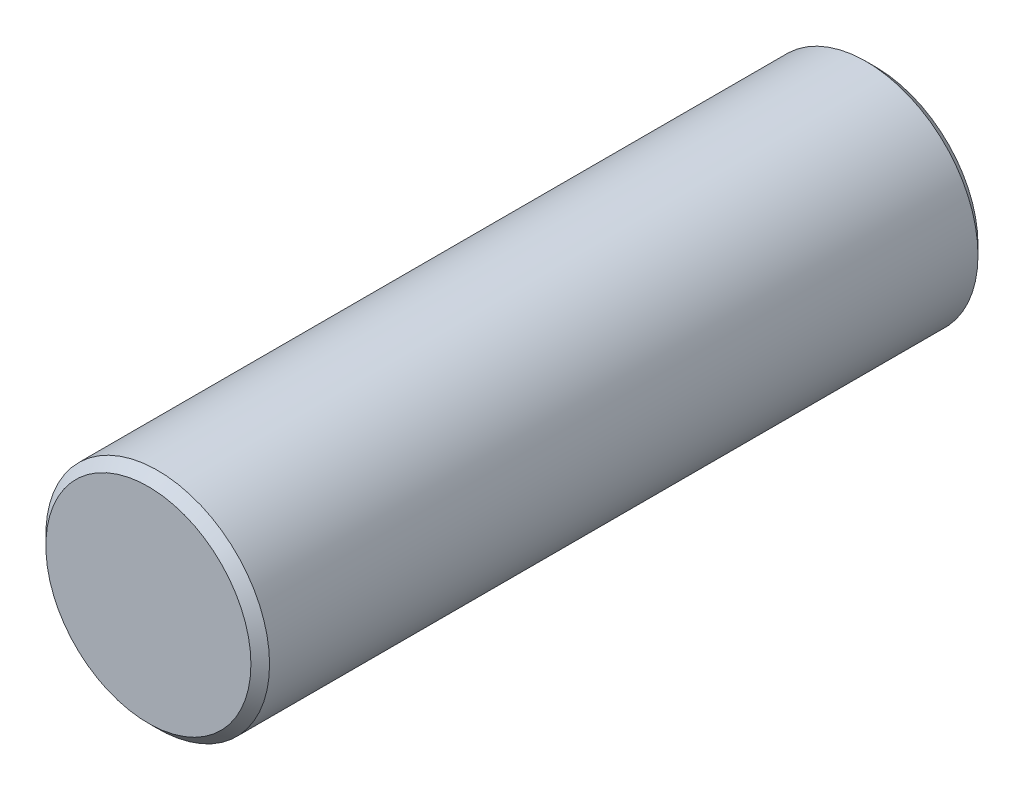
ISO-10303-21;
HEADER;
FILE_DESCRIPTION(('STEP AP214'),'2;1');
FILE_NAME('part.step','',(''),(''),'','','');
FILE_SCHEMA(('AUTOMOTIVE_DESIGN { 1 0 10303 214 1 1 1 1 }'));
ENDSEC;
DATA;
#1=APPLICATION_CONTEXT('core data for automotive mechanical design processes');
#2=APPLICATION_PROTOCOL_DEFINITION('international standard','automotive_design',2000,#1);
#3=PRODUCT_CONTEXT('',#1,'mechanical');
#4=PRODUCT('Part','Part','',(#3));
#5=PRODUCT_RELATED_PRODUCT_CATEGORY('part','',(#4));
#6=PRODUCT_DEFINITION_FORMATION('','',#4);
#7=PRODUCT_DEFINITION_CONTEXT('part definition',#1,'design');
#8=PRODUCT_DEFINITION('design','',#6,#7);
#9=PRODUCT_DEFINITION_SHAPE('','',#8);
#10=(LENGTH_UNIT() NAMED_UNIT(*) SI_UNIT(.MILLI.,.METRE.));
#11=(NAMED_UNIT(*) PLANE_ANGLE_UNIT() SI_UNIT($,.RADIAN.));
#12=(NAMED_UNIT(*) SI_UNIT($,.STERADIAN.) SOLID_ANGLE_UNIT());
#13=UNCERTAINTY_MEASURE_WITH_UNIT(LENGTH_MEASURE(1.E-05),#10,'distance_accuracy_value','');
#14=(GEOMETRIC_REPRESENTATION_CONTEXT(3) GLOBAL_UNCERTAINTY_ASSIGNED_CONTEXT((#13)) GLOBAL_UNIT_ASSIGNED_CONTEXT((#10,
#11,#12)) REPRESENTATION_CONTEXT('',''));
#15=CARTESIAN_POINT('',(0.,0.,0.));
#16=DIRECTION('',(0.,0.,1.));
#17=DIRECTION('',(1.,0.,0.));
#18=AXIS2_PLACEMENT_3D('',#15,#16,#17);
#19=CARTESIAN_POINT('',(-183.814037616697,43.4264159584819,19.5));
#20=DIRECTION('',(0.,0.,-1.));
#21=DIRECTION('',(-1.,0.,0.));
#22=AXIS2_PLACEMENT_3D('',#19,#20,#21);
#23=CYLINDRICAL_SURFACE('',#22,6.00000000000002);
#24=CARTESIAN_POINT('',(-183.814037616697,43.4264159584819,19.));
#25=DIRECTION('',(0.,0.,1.));
#26=DIRECTION('',(1.,0.,0.));
#27=AXIS2_PLACEMENT_3D('',#24,#25,#26);
#28=CIRCLE('',#27,6.00000000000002);
#29=CARTESIAN_POINT('',(-177.814037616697,43.4264159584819,19.));
#30=VERTEX_POINT('',#29);
#31=EDGE_CURVE('E355',#30,#30,#28,.F.);
#32=ORIENTED_EDGE('',*,*,#31,.T.);
#33=EDGE_LOOP('',(#32));
#34=FACE_BOUND('',#33,.T.);
#35=CARTESIAN_POINT('',(-183.814037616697,43.4264159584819,-19.));
#36=DIRECTION('',(0.,0.,1.));
#37=DIRECTION('',(1.,0.,0.));
#38=AXIS2_PLACEMENT_3D('',#35,#36,#37);
#39=CIRCLE('',#38,6.00000000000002);
#40=CARTESIAN_POINT('',(-177.814037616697,43.4264159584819,-19.));
#41=VERTEX_POINT('',#40);
#42=EDGE_CURVE('E360',#41,#41,#39,.T.);
#43=ORIENTED_EDGE('',*,*,#42,.T.);
#44=EDGE_LOOP('',(#43));
#45=FACE_BOUND('',#44,.T.);
#46=ADVANCED_FACE('F349',(#34,#45),#23,.T.);
#47=CARTESIAN_POINT('',(-183.814037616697,43.4264159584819,19.5));
#48=DIRECTION('',(0.,0.,1.));
#49=DIRECTION('',(1.,0.,0.));
#50=AXIS2_PLACEMENT_3D('',#47,#48,#49);
#51=PLANE('',#50);
#52=CARTESIAN_POINT('',(-183.814037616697,43.4264159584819,19.5));
#53=DIRECTION('',(0.,0.,1.));
#54=DIRECTION('',(1.,0.,0.));
#55=AXIS2_PLACEMENT_3D('',#52,#53,#54);
#56=CIRCLE('',#55,5.50000000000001);
#57=CARTESIAN_POINT('',(-178.314037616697,43.4264159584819,19.5));
#58=VERTEX_POINT('',#57);
#59=EDGE_CURVE('E364',#58,#58,#56,.T.);
#60=ORIENTED_EDGE('',*,*,#59,.T.);
#61=EDGE_LOOP('',(#60));
#62=FACE_BOUND('',#61,.T.);
#63=ADVANCED_FACE('F370',(#62),#51,.T.);
#64=CARTESIAN_POINT('',(-183.814037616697,43.4264159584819,-19.5));
#65=DIRECTION('',(0.,0.,1.));
#66=DIRECTION('',(1.,0.,0.));
#67=AXIS2_PLACEMENT_3D('',#64,#65,#66);
#68=PLANE('',#67);
#69=CARTESIAN_POINT('',(-183.814037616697,43.4264159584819,-19.5));
#70=DIRECTION('',(0.,0.,1.));
#71=DIRECTION('',(1.,0.,0.));
#72=AXIS2_PLACEMENT_3D('',#69,#70,#71);
#73=CIRCLE('',#72,5.50000000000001);
#74=CARTESIAN_POINT('',(-178.314037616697,43.4264159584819,-19.5));
#75=VERTEX_POINT('',#74);
#76=EDGE_CURVE('E10',#75,#75,#73,.F.);
#77=ORIENTED_EDGE('',*,*,#76,.T.);
#78=EDGE_LOOP('',(#77));
#79=FACE_BOUND('',#78,.T.);
#80=ADVANCED_FACE('F375',(#79),#68,.F.);
#81=CARTESIAN_POINT('',(-183.814037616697,43.4264159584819,19.5));
#82=DIRECTION('',(0.,0.,-1.));
#83=DIRECTION('',(-1.,0.,0.));
#84=AXIS2_PLACEMENT_3D('',#81,#82,#83);
#85=CONICAL_SURFACE('',#84,5.50000000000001,0.785398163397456);
#86=ORIENTED_EDGE('',*,*,#31,.F.);
#87=EDGE_LOOP('',(#86));
#88=FACE_BOUND('',#87,.T.);
#89=ORIENTED_EDGE('',*,*,#59,.F.);
#90=EDGE_LOOP('',(#89));
#91=FACE_BOUND('',#90,.T.);
#92=ADVANCED_FACE('F372',(#88,#91),#85,.T.);
#93=CARTESIAN_POINT('',(-183.814037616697,43.4264159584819,-19.));
#94=DIRECTION('',(0.,0.,1.));
#95=DIRECTION('',(1.,0.,0.));
#96=AXIS2_PLACEMENT_3D('',#93,#94,#95);
#97=CONICAL_SURFACE('',#96,6.00000000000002,0.785398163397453);
#98=ORIENTED_EDGE('',*,*,#76,.F.);
#99=EDGE_LOOP('',(#98));
#100=FACE_BOUND('',#99,.T.);
#101=ORIENTED_EDGE('',*,*,#42,.F.);
#102=EDGE_LOOP('',(#101));
#103=FACE_BOUND('',#102,.T.);
#104=ADVANCED_FACE('F374',(#100,#103),#97,.T.);
#105=CLOSED_SHELL('',(#46,#63,#80,#92,#104));
#106=MANIFOLD_SOLID_BREP('B2',#105);
#107=ADVANCED_BREP_SHAPE_REPRESENTATION('',(#18,#106),#14);
#108=SHAPE_DEFINITION_REPRESENTATION(#9,#107);
ENDSEC;
END-ISO-10303-21;
